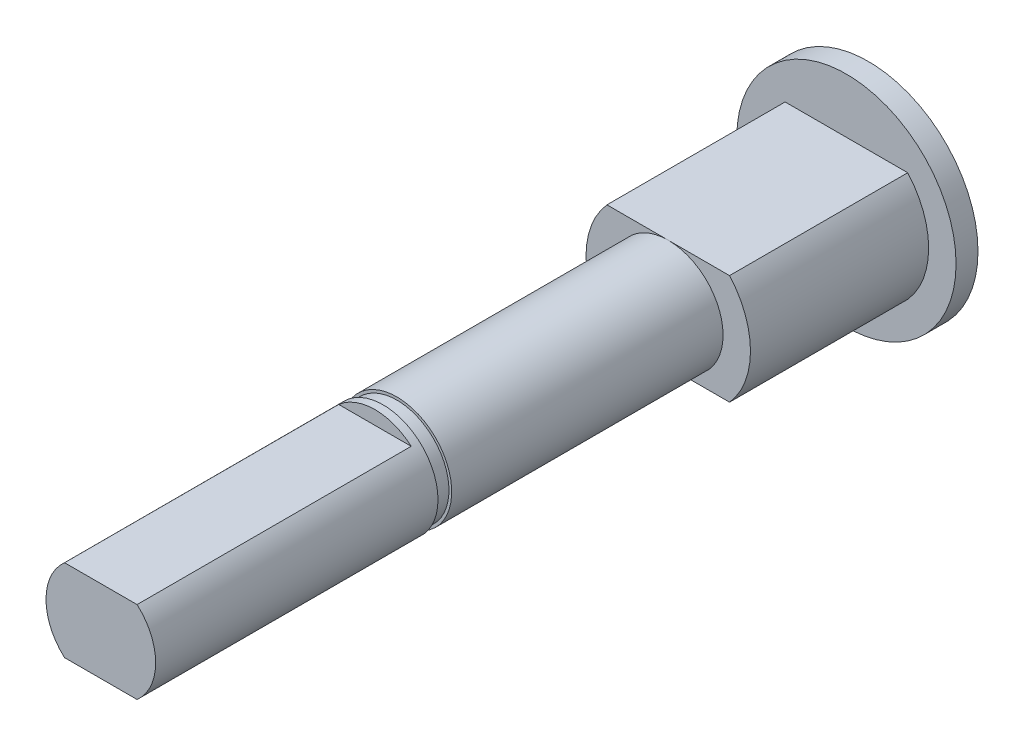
from build123d import *
from build123d.topology import SkipClean

# Parameters (mm, degrees)
EXTRUSION1_DEPTH = 6.5
ESQUISSE2_R      = 4
EXTRUSION2_DEPTH = 0.8
ESQUISSE3_R      = 2
EXTRUSION3_DEPTH = 10.7
ESQUISSE4_W      = 0.5
ESQUISSE4_H      = 0.589327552
EXTRUSION4_DEPTH = 10


with BuildPart() as part:
    # Esquisse1 → Extrusion1 (new body)
    with BuildSketch(Plane.XY):
        with BuildLine():
            Line((-2.236067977, 2), (2.236067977, 2))
            ThreePointArc((2.236067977, 2), (3, 0), (2.236067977, -2))
            Line((2.236067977, -2), (-2.236067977, -2))
            ThreePointArc((-2.236067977, -2), (-3, 0), (-2.236067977, 2))
        make_face()
    extrude(amount=EXTRUSION1_DEPTH)

    # Esquisse2 → Extrusion2 (add)
    with BuildSketch(Plane(origin=(0, 0, 0), x_dir=(-1, 0, 0), z_dir=(0, 0, -1))):
        Circle(ESQUISSE2_R)
    extrude(amount=EXTRUSION2_DEPTH)

    # Esquisse3 → Extrusion3 (add)
    with BuildSketch(Plane.XY.offset(6.5)):
        with Locations(Location((0, 0, 0), (0, 0, 270))):
            Circle(ESQUISSE3_R)
    extrude(amount=EXTRUSION3_DEPTH)

    # Esquisse4 → Enl_vement de mati_re-R_volution1 (revolve, cut)
    with BuildSketch(Plane(origin=(0, 0, 0), x_dir=(0, 0, -1), z_dir=(1, 0, 0)), mode=Mode.PRIVATE) as enl_vement_de_mati_re_r_volution1_sk:
        with Locations((-16.65, 2.194663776)):
            Rectangle(ESQUISSE4_W, ESQUISSE4_H)
    revolve(enl_vement_de_mati_re_r_volution1_sk.sketch.rotate(Axis((0, 0, 0), (0, 0, 1)), 90), axis=Axis((0, 0, 0), (0, 0, 1)), mode=Mode.SUBTRACT)

    # Esquisse5 → Extrusion4 (add)
    with SkipClean():  # the faces are left unmerged after this step: merging them gives an invalid solid
        with BuildSketch(Plane.XY.offset(17.2)):
            with BuildLine():
                Line((-1.322875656, 1.5), (1.322875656, 1.5))
                ThreePointArc((1.322875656, 1.5), (2, 0), (1.322875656, -1.5))
                Line((1.322875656, -1.5), (-1.322875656, -1.5))
                ThreePointArc((-1.322875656, -1.5), (-2, 0), (-1.322875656, 1.5))
            make_face()
        extrude(amount=EXTRUSION4_DEPTH)


solid = part.part
